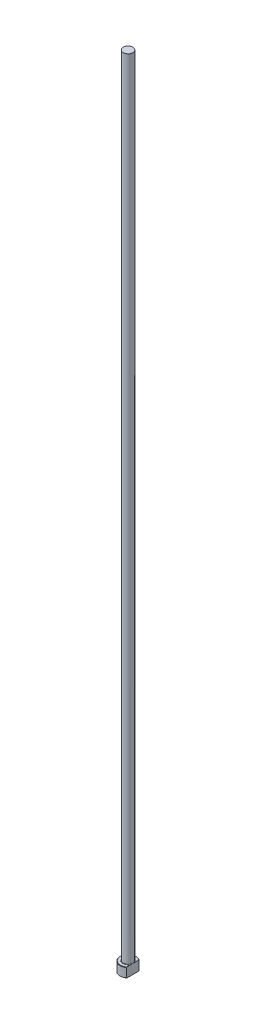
from build123d import *
from build123d.topology import SkipClean

# Parameters (mm, degrees)
CHAMFER1_SIZE    = 0.2
FILLET1_R        = 0.2
KEYED_HEAD_DEPTH = 501.0499975


with BuildPart() as part:
    # Sketch1 → Revolve1 (revolve)
    with BuildSketch(Plane.XY, mode=Mode.PRIVATE) as revolve1_sk:
        Polygon((0, 0), (-5, 0), (-5, 6), (-3, 6), (-3, 500), (0, 500), align=None)
    revolve(revolve1_sk.sketch.rotate(Axis((0, 259.958771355, 0), (0, -1, 0)), 270), axis=Axis((0, 259.958771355, 0), (0, -1, 0)))

    # Chamfer1
    chamfer1_edges = [part.edges().sort_by_distance(p)[0] for p in [
        (0, 6, -5),
        (0, 0, -5),
    ]]
    chamfer(chamfer1_edges, length=CHAMFER1_SIZE)

    # Fillet1
    fillet1_edges = [part.edges().sort_by_distance(p)[0] for p in [
        (0, 6, -3),
    ]]
    fillet(fillet1_edges, radius=FILLET1_R)

    # Sketch2 → KEYED HEAD (cut, through all)
    with SkipClean():  # the faces are left unmerged after this step: merging them gives an invalid solid
        with BuildSketch(Plane(origin=(0, 0, 0), x_dir=(1, 0, 0), z_dir=(0, 1, 0))):
            with BuildLine():
                Line((3, -4), (3, 4))
                ThreePointArc((3, 4), (5, 0), (3, -4))
            make_face()
        extrude(amount=KEYED_HEAD_DEPTH, mode=Mode.SUBTRACT)


solid = part.part
